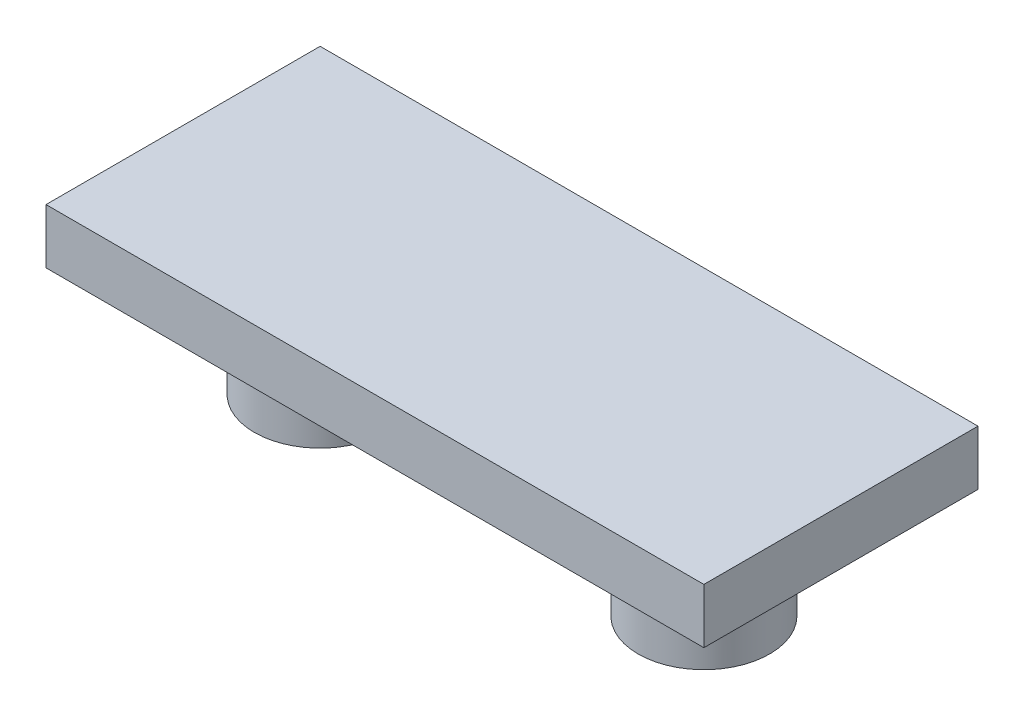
ISO-10303-21;
HEADER;
FILE_DESCRIPTION(('STEP AP214'),'2;1');
FILE_NAME('part.step','',(''),(''),'','','');
FILE_SCHEMA(('AUTOMOTIVE_DESIGN { 1 0 10303 214 1 1 1 1 }'));
ENDSEC;
DATA;
#1=APPLICATION_CONTEXT('core data for automotive mechanical design processes');
#2=APPLICATION_PROTOCOL_DEFINITION('international standard','automotive_design',2000,#1);
#3=PRODUCT_CONTEXT('',#1,'mechanical');
#4=PRODUCT('Part','Part','',(#3));
#5=PRODUCT_RELATED_PRODUCT_CATEGORY('part','',(#4));
#6=PRODUCT_DEFINITION_FORMATION('','',#4);
#7=PRODUCT_DEFINITION_CONTEXT('part definition',#1,'design');
#8=PRODUCT_DEFINITION('design','',#6,#7);
#9=PRODUCT_DEFINITION_SHAPE('','',#8);
#10=(LENGTH_UNIT() NAMED_UNIT(*) SI_UNIT(.MILLI.,.METRE.));
#11=(NAMED_UNIT(*) PLANE_ANGLE_UNIT() SI_UNIT($,.RADIAN.));
#12=(NAMED_UNIT(*) SI_UNIT($,.STERADIAN.) SOLID_ANGLE_UNIT());
#13=UNCERTAINTY_MEASURE_WITH_UNIT(LENGTH_MEASURE(1.E-05),#10,'distance_accuracy_value','');
#14=(GEOMETRIC_REPRESENTATION_CONTEXT(3) GLOBAL_UNCERTAINTY_ASSIGNED_CONTEXT((#13)) GLOBAL_UNIT_ASSIGNED_CONTEXT((#10,
#11,#12)) REPRESENTATION_CONTEXT('',''));
#15=CARTESIAN_POINT('',(0.,0.,0.));
#16=DIRECTION('',(0.,0.,1.));
#17=DIRECTION('',(1.,0.,0.));
#18=AXIS2_PLACEMENT_3D('',#15,#16,#17);
#19=CARTESIAN_POINT('',(0.,-10.,0.));
#20=DIRECTION('',(-1.,0.,0.));
#21=DIRECTION('',(0.,0.,1.));
#22=AXIS2_PLACEMENT_3D('',#19,#20,#21);
#23=PLANE('',#22);
#24=DIRECTION('',(0.,0.,1.));
#25=VECTOR('',#24,1.);
#26=CARTESIAN_POINT('',(0.,0.,0.));
#27=LINE('',#26,#25);
#28=CARTESIAN_POINT('',(0.,0.,-50.));
#29=VERTEX_POINT('',#28);
#30=CARTESIAN_POINT('',(0.,0.,0.));
#31=VERTEX_POINT('',#30);
#32=EDGE_CURVE('E110',#29,#31,#27,.T.);
#33=ORIENTED_EDGE('',*,*,#32,.F.);
#34=DIRECTION('',(0.,1.,0.));
#35=VECTOR('',#34,1.);
#36=CARTESIAN_POINT('',(0.,-10.,-50.));
#37=LINE('',#36,#35);
#38=CARTESIAN_POINT('',(0.,-10.,-50.));
#39=VERTEX_POINT('',#38);
#40=EDGE_CURVE('E60',#39,#29,#37,.T.);
#41=ORIENTED_EDGE('',*,*,#40,.F.);
#42=DIRECTION('',(0.,0.,1.));
#43=VECTOR('',#42,1.);
#44=CARTESIAN_POINT('',(0.,-10.,0.));
#45=LINE('',#44,#43);
#46=CARTESIAN_POINT('',(0.,-10.,0.));
#47=VERTEX_POINT('',#46);
#48=EDGE_CURVE('E99',#39,#47,#45,.T.);
#49=ORIENTED_EDGE('',*,*,#48,.T.);
#50=DIRECTION('',(0.,1.,0.));
#51=VECTOR('',#50,1.);
#52=CARTESIAN_POINT('',(0.,-10.,0.));
#53=LINE('',#52,#51);
#54=EDGE_CURVE('E45',#47,#31,#53,.T.);
#55=ORIENTED_EDGE('',*,*,#54,.T.);
#56=EDGE_LOOP('',(#33,#41,#49,#55));
#57=FACE_BOUND('',#56,.T.);
#58=ADVANCED_FACE('F39',(#57),#23,.T.);
#59=CARTESIAN_POINT('',(0.,-10.,-50.));
#60=DIRECTION('',(0.,0.,-1.));
#61=DIRECTION('',(-1.,0.,0.));
#62=AXIS2_PLACEMENT_3D('',#59,#60,#61);
#63=PLANE('',#62);
#64=DIRECTION('',(-1.,0.,0.));
#65=VECTOR('',#64,1.);
#66=CARTESIAN_POINT('',(0.,0.,-50.));
#67=LINE('',#66,#65);
#68=CARTESIAN_POINT('',(120.,0.,-50.));
#69=VERTEX_POINT('',#68);
#70=EDGE_CURVE('E105',#69,#29,#67,.T.);
#71=ORIENTED_EDGE('',*,*,#70,.F.);
#72=DIRECTION('',(0.,1.,0.));
#73=VECTOR('',#72,1.);
#74=CARTESIAN_POINT('',(120.,-10.,-50.));
#75=LINE('',#74,#73);
#76=CARTESIAN_POINT('',(120.,-10.,-50.));
#77=VERTEX_POINT('',#76);
#78=EDGE_CURVE('E74',#77,#69,#75,.T.);
#79=ORIENTED_EDGE('',*,*,#78,.F.);
#80=DIRECTION('',(-1.,0.,0.));
#81=VECTOR('',#80,1.);
#82=CARTESIAN_POINT('',(0.,-10.,-50.));
#83=LINE('',#82,#81);
#84=EDGE_CURVE('E100',#77,#39,#83,.T.);
#85=ORIENTED_EDGE('',*,*,#84,.T.);
#86=ORIENTED_EDGE('',*,*,#40,.T.);
#87=EDGE_LOOP('',(#71,#79,#85,#86));
#88=FACE_BOUND('',#87,.T.);
#89=ADVANCED_FACE('F138',(#88),#63,.T.);
#90=CARTESIAN_POINT('',(120.,-10.,0.));
#91=DIRECTION('',(1.,0.,0.));
#92=DIRECTION('',(0.,0.,-1.));
#93=AXIS2_PLACEMENT_3D('',#90,#91,#92);
#94=PLANE('',#93);
#95=DIRECTION('',(0.,0.,-1.));
#96=VECTOR('',#95,1.);
#97=CARTESIAN_POINT('',(120.,0.,0.));
#98=LINE('',#97,#96);
#99=CARTESIAN_POINT('',(120.,0.,0.));
#100=VERTEX_POINT('',#99);
#101=EDGE_CURVE('E95',#100,#69,#98,.T.);
#102=ORIENTED_EDGE('',*,*,#101,.F.);
#103=DIRECTION('',(0.,1.,0.));
#104=VECTOR('',#103,1.);
#105=CARTESIAN_POINT('',(120.,-10.,0.));
#106=LINE('',#105,#104);
#107=CARTESIAN_POINT('',(120.,-10.,0.));
#108=VERTEX_POINT('',#107);
#109=EDGE_CURVE('E87',#108,#100,#106,.T.);
#110=ORIENTED_EDGE('',*,*,#109,.F.);
#111=DIRECTION('',(0.,0.,-1.));
#112=VECTOR('',#111,1.);
#113=CARTESIAN_POINT('',(120.,-10.,0.));
#114=LINE('',#113,#112);
#115=EDGE_CURVE('E89',#108,#77,#114,.T.);
#116=ORIENTED_EDGE('',*,*,#115,.T.);
#117=ORIENTED_EDGE('',*,*,#78,.T.);
#118=EDGE_LOOP('',(#102,#110,#116,#117));
#119=FACE_BOUND('',#118,.T.);
#120=ADVANCED_FACE('F90',(#119),#94,.T.);
#121=CARTESIAN_POINT('',(0.,-10.,0.));
#122=DIRECTION('',(0.,0.,1.));
#123=DIRECTION('',(1.,0.,0.));
#124=AXIS2_PLACEMENT_3D('',#121,#122,#123);
#125=PLANE('',#124);
#126=DIRECTION('',(1.,0.,0.));
#127=VECTOR('',#126,1.);
#128=CARTESIAN_POINT('',(0.,0.,0.));
#129=LINE('',#128,#127);
#130=EDGE_CURVE('E109',#31,#100,#129,.T.);
#131=ORIENTED_EDGE('',*,*,#130,.F.);
#132=ORIENTED_EDGE('',*,*,#54,.F.);
#133=DIRECTION('',(1.,0.,0.));
#134=VECTOR('',#133,1.);
#135=CARTESIAN_POINT('',(0.,-10.,0.));
#136=LINE('',#135,#134);
#137=EDGE_CURVE('E96',#47,#108,#136,.T.);
#138=ORIENTED_EDGE('',*,*,#137,.T.);
#139=ORIENTED_EDGE('',*,*,#109,.T.);
#140=EDGE_LOOP('',(#131,#132,#138,#139));
#141=FACE_BOUND('',#140,.T.);
#142=ADVANCED_FACE('F97',(#141),#125,.T.);
#143=CARTESIAN_POINT('',(0.,-10.,0.));
#144=DIRECTION('',(0.,-1.,0.));
#145=DIRECTION('',(0.,0.,-1.));
#146=AXIS2_PLACEMENT_3D('',#143,#144,#145);
#147=PLANE('',#146);
#148=CARTESIAN_POINT('',(95.,-10.,-25.));
#149=DIRECTION('',(0.,-1.,0.));
#150=DIRECTION('',(0.,0.,-1.));
#151=AXIS2_PLACEMENT_3D('',#148,#149,#150);
#152=CIRCLE('',#151,12.);
#153=CARTESIAN_POINT('',(95.,-10.,-37.));
#154=VERTEX_POINT('',#153);
#155=EDGE_CURVE('E11',#154,#154,#152,.T.);
#156=ORIENTED_EDGE('',*,*,#155,.F.);
#157=EDGE_LOOP('',(#156));
#158=FACE_BOUND('',#157,.T.);
#159=CARTESIAN_POINT('',(25.,-10.,-25.));
#160=DIRECTION('',(0.,-1.,0.));
#161=DIRECTION('',(0.,0.,-1.));
#162=AXIS2_PLACEMENT_3D('',#159,#160,#161);
#163=CIRCLE('',#162,12.);
#164=CARTESIAN_POINT('',(25.,-10.,-37.));
#165=VERTEX_POINT('',#164);
#166=EDGE_CURVE('E48',#165,#165,#163,.T.);
#167=ORIENTED_EDGE('',*,*,#166,.F.);
#168=EDGE_LOOP('',(#167));
#169=FACE_BOUND('',#168,.T.);
#170=ORIENTED_EDGE('',*,*,#48,.F.);
#171=ORIENTED_EDGE('',*,*,#84,.F.);
#172=ORIENTED_EDGE('',*,*,#115,.F.);
#173=ORIENTED_EDGE('',*,*,#137,.F.);
#174=EDGE_LOOP('',(#170,#171,#172,#173));
#175=FACE_BOUND('',#174,.T.);
#176=ADVANCED_FACE('F92',(#158,#169,#175),#147,.T.);
#177=CARTESIAN_POINT('',(0.,0.,0.));
#178=DIRECTION('',(0.,-1.,0.));
#179=DIRECTION('',(0.,0.,-1.));
#180=AXIS2_PLACEMENT_3D('',#177,#178,#179);
#181=PLANE('',#180);
#182=ORIENTED_EDGE('',*,*,#32,.T.);
#183=ORIENTED_EDGE('',*,*,#130,.T.);
#184=ORIENTED_EDGE('',*,*,#101,.T.);
#185=ORIENTED_EDGE('',*,*,#70,.T.);
#186=EDGE_LOOP('',(#182,#183,#184,#185));
#187=FACE_BOUND('',#186,.T.);
#188=ADVANCED_FACE('F144',(#187),#181,.F.);
#189=CARTESIAN_POINT('',(25.,-30.,-25.));
#190=DIRECTION('',(0.,1.,0.));
#191=DIRECTION('',(0.,0.,1.));
#192=AXIS2_PLACEMENT_3D('',#189,#190,#191);
#193=CYLINDRICAL_SURFACE('',#192,12.);
#194=ORIENTED_EDGE('',*,*,#166,.T.);
#195=EDGE_LOOP('',(#194));
#196=FACE_BOUND('',#195,.T.);
#197=CARTESIAN_POINT('',(25.,-30.,-25.));
#198=DIRECTION('',(0.,1.,0.));
#199=DIRECTION('',(0.,0.,1.));
#200=AXIS2_PLACEMENT_3D('',#197,#198,#199);
#201=CIRCLE('',#200,12.);
#202=CARTESIAN_POINT('',(25.,-30.,-13.));
#203=VERTEX_POINT('',#202);
#204=EDGE_CURVE('E112',#203,#203,#201,.T.);
#205=ORIENTED_EDGE('',*,*,#204,.T.);
#206=EDGE_LOOP('',(#205));
#207=FACE_BOUND('',#206,.T.);
#208=ADVANCED_FACE('F150',(#196,#207),#193,.T.);
#209=CARTESIAN_POINT('',(25.,-30.,-25.));
#210=DIRECTION('',(0.,1.,0.));
#211=DIRECTION('',(0.,0.,1.));
#212=AXIS2_PLACEMENT_3D('',#209,#210,#211);
#213=PLANE('',#212);
#214=ORIENTED_EDGE('',*,*,#204,.F.);
#215=EDGE_LOOP('',(#214));
#216=FACE_BOUND('',#215,.T.);
#217=ADVANCED_FACE('F131',(#216),#213,.F.);
#218=CARTESIAN_POINT('',(95.,-30.,-25.));
#219=DIRECTION('',(0.,1.,0.));
#220=DIRECTION('',(0.,0.,1.));
#221=AXIS2_PLACEMENT_3D('',#218,#219,#220);
#222=CYLINDRICAL_SURFACE('',#221,12.);
#223=ORIENTED_EDGE('',*,*,#155,.T.);
#224=EDGE_LOOP('',(#223));
#225=FACE_BOUND('',#224,.T.);
#226=CARTESIAN_POINT('',(95.,-30.,-25.));
#227=DIRECTION('',(0.,1.,0.));
#228=DIRECTION('',(0.,0.,1.));
#229=AXIS2_PLACEMENT_3D('',#226,#227,#228);
#230=CIRCLE('',#229,12.);
#231=CARTESIAN_POINT('',(95.,-30.,-13.));
#232=VERTEX_POINT('',#231);
#233=EDGE_CURVE('E125',#232,#232,#230,.T.);
#234=ORIENTED_EDGE('',*,*,#233,.T.);
#235=EDGE_LOOP('',(#234));
#236=FACE_BOUND('',#235,.T.);
#237=ADVANCED_FACE('F130',(#225,#236),#222,.T.);
#238=CARTESIAN_POINT('',(95.,-30.,-25.));
#239=DIRECTION('',(0.,1.,0.));
#240=DIRECTION('',(0.,0.,1.));
#241=AXIS2_PLACEMENT_3D('',#238,#239,#240);
#242=PLANE('',#241);
#243=ORIENTED_EDGE('',*,*,#233,.F.);
#244=EDGE_LOOP('',(#243));
#245=FACE_BOUND('',#244,.T.);
#246=ADVANCED_FACE('F129',(#245),#242,.F.);
#247=CLOSED_SHELL('',(#58,#89,#120,#142,#176,#188,#208,#217,#237,#246));
#248=MANIFOLD_SOLID_BREP('B2',#247);
#249=ADVANCED_BREP_SHAPE_REPRESENTATION('',(#18,#248),#14);
#250=SHAPE_DEFINITION_REPRESENTATION(#9,#249);
ENDSEC;
END-ISO-10303-21;
